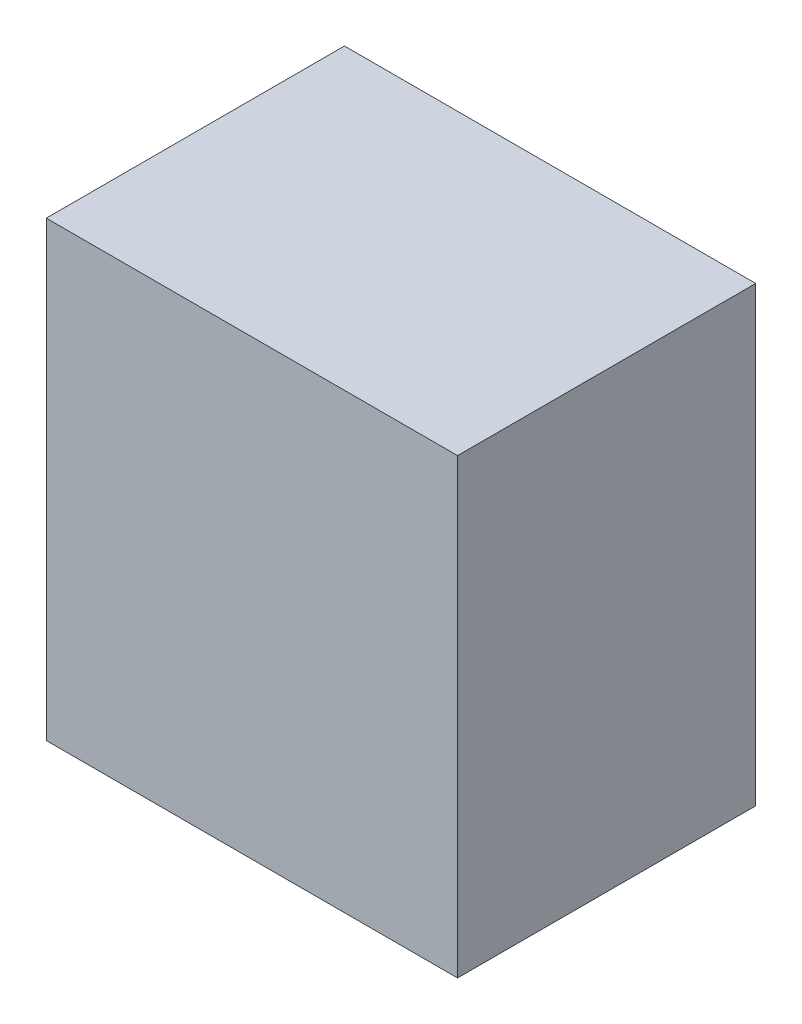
ISO-10303-21;
HEADER;
FILE_DESCRIPTION(('STEP AP214'),'2;1');
FILE_NAME('part.step','',(''),(''),'','','');
FILE_SCHEMA(('AUTOMOTIVE_DESIGN { 1 0 10303 214 1 1 1 1 }'));
ENDSEC;
DATA;
#1=APPLICATION_CONTEXT('core data for automotive mechanical design processes');
#2=APPLICATION_PROTOCOL_DEFINITION('international standard','automotive_design',2000,#1);
#3=PRODUCT_CONTEXT('',#1,'mechanical');
#4=PRODUCT('Part','Part','',(#3));
#5=PRODUCT_RELATED_PRODUCT_CATEGORY('part','',(#4));
#6=PRODUCT_DEFINITION_FORMATION('','',#4);
#7=PRODUCT_DEFINITION_CONTEXT('part definition',#1,'design');
#8=PRODUCT_DEFINITION('design','',#6,#7);
#9=PRODUCT_DEFINITION_SHAPE('','',#8);
#10=(LENGTH_UNIT() NAMED_UNIT(*) SI_UNIT(.MILLI.,.METRE.));
#11=(NAMED_UNIT(*) PLANE_ANGLE_UNIT() SI_UNIT($,.RADIAN.));
#12=(NAMED_UNIT(*) SI_UNIT($,.STERADIAN.) SOLID_ANGLE_UNIT());
#13=UNCERTAINTY_MEASURE_WITH_UNIT(LENGTH_MEASURE(1.E-05),#10,'distance_accuracy_value','');
#14=(GEOMETRIC_REPRESENTATION_CONTEXT(3) GLOBAL_UNCERTAINTY_ASSIGNED_CONTEXT((#13)) GLOBAL_UNIT_ASSIGNED_CONTEXT((#10,
#11,#12)) REPRESENTATION_CONTEXT('',''));
#15=CARTESIAN_POINT('',(0.,0.,0.));
#16=DIRECTION('',(0.,0.,1.));
#17=DIRECTION('',(1.,0.,0.));
#18=AXIS2_PLACEMENT_3D('',#15,#16,#17);
#19=CARTESIAN_POINT('',(0.,0.,0.));
#20=DIRECTION('',(0.,-1.,0.));
#21=DIRECTION('',(0.,0.,-1.));
#22=AXIS2_PLACEMENT_3D('',#19,#20,#21);
#23=PLANE('',#22);
#24=DIRECTION('',(0.,0.,-1.));
#25=VECTOR('',#24,1.);
#26=CARTESIAN_POINT('',(2.,0.,1.45));
#27=LINE('',#26,#25);
#28=CARTESIAN_POINT('',(2.,0.,1.45));
#29=VERTEX_POINT('',#28);
#30=CARTESIAN_POINT('',(2.,0.,-1.45));
#31=VERTEX_POINT('',#30);
#32=EDGE_CURVE('E120',#29,#31,#27,.T.);
#33=ORIENTED_EDGE('',*,*,#32,.F.);
#34=DIRECTION('',(1.,0.,0.));
#35=VECTOR('',#34,1.);
#36=CARTESIAN_POINT('',(-2.,0.,1.45));
#37=LINE('',#36,#35);
#38=CARTESIAN_POINT('',(-2.,0.,1.45));
#39=VERTEX_POINT('',#38);
#40=EDGE_CURVE('E20',#39,#29,#37,.T.);
#41=ORIENTED_EDGE('',*,*,#40,.F.);
#42=DIRECTION('',(0.,0.,1.));
#43=VECTOR('',#42,1.);
#44=CARTESIAN_POINT('',(-2.,0.,1.45));
#45=LINE('',#44,#43);
#46=CARTESIAN_POINT('',(-2.,0.,-1.45));
#47=VERTEX_POINT('',#46);
#48=EDGE_CURVE('E71',#47,#39,#45,.T.);
#49=ORIENTED_EDGE('',*,*,#48,.F.);
#50=DIRECTION('',(-1.,0.,0.));
#51=VECTOR('',#50,1.);
#52=CARTESIAN_POINT('',(-2.,0.,-1.45));
#53=LINE('',#52,#51);
#54=EDGE_CURVE('E74',#31,#47,#53,.T.);
#55=ORIENTED_EDGE('',*,*,#54,.F.);
#56=EDGE_LOOP('',(#33,#41,#49,#55));
#57=FACE_BOUND('',#56,.T.);
#58=ADVANCED_FACE('F17',(#57),#23,.T.);
#59=CARTESIAN_POINT('',(0.,4.4,0.));
#60=DIRECTION('',(0.,-1.,0.));
#61=DIRECTION('',(0.,0.,-1.));
#62=AXIS2_PLACEMENT_3D('',#59,#60,#61);
#63=PLANE('',#62);
#64=DIRECTION('',(0.,0.,-1.));
#65=VECTOR('',#64,1.);
#66=CARTESIAN_POINT('',(2.,4.4,1.45));
#67=LINE('',#66,#65);
#68=CARTESIAN_POINT('',(2.,4.4,1.45));
#69=VERTEX_POINT('',#68);
#70=CARTESIAN_POINT('',(2.,4.4,-1.45));
#71=VERTEX_POINT('',#70);
#72=EDGE_CURVE('E102',#69,#71,#67,.T.);
#73=ORIENTED_EDGE('',*,*,#72,.T.);
#74=DIRECTION('',(-1.,0.,0.));
#75=VECTOR('',#74,1.);
#76=CARTESIAN_POINT('',(-2.,4.4,-1.45));
#77=LINE('',#76,#75);
#78=CARTESIAN_POINT('',(-2.,4.4,-1.45));
#79=VERTEX_POINT('',#78);
#80=EDGE_CURVE('E80',#71,#79,#77,.T.);
#81=ORIENTED_EDGE('',*,*,#80,.T.);
#82=DIRECTION('',(0.,0.,1.));
#83=VECTOR('',#82,1.);
#84=CARTESIAN_POINT('',(-2.,4.4,1.45));
#85=LINE('',#84,#83);
#86=CARTESIAN_POINT('',(-2.,4.4,1.45));
#87=VERTEX_POINT('',#86);
#88=EDGE_CURVE('E85',#79,#87,#85,.T.);
#89=ORIENTED_EDGE('',*,*,#88,.T.);
#90=DIRECTION('',(1.,0.,0.));
#91=VECTOR('',#90,1.);
#92=CARTESIAN_POINT('',(-2.,4.4,1.45));
#93=LINE('',#92,#91);
#94=EDGE_CURVE('E11',#87,#69,#93,.T.);
#95=ORIENTED_EDGE('',*,*,#94,.T.);
#96=EDGE_LOOP('',(#73,#81,#89,#95));
#97=FACE_BOUND('',#96,.T.);
#98=ADVANCED_FACE('F131',(#97),#63,.F.);
#99=CARTESIAN_POINT('',(-2.,4.4,1.45));
#100=DIRECTION('',(0.,0.,-1.));
#101=DIRECTION('',(0.,-1.,0.));
#102=AXIS2_PLACEMENT_3D('',#99,#100,#101);
#103=PLANE('',#102);
#104=ORIENTED_EDGE('',*,*,#40,.T.);
#105=DIRECTION('',(0.,-1.,0.));
#106=VECTOR('',#105,1.);
#107=CARTESIAN_POINT('',(2.,4.4,1.45));
#108=LINE('',#107,#106);
#109=EDGE_CURVE('E95',#69,#29,#108,.T.);
#110=ORIENTED_EDGE('',*,*,#109,.F.);
#111=ORIENTED_EDGE('',*,*,#94,.F.);
#112=DIRECTION('',(0.,-1.,0.));
#113=VECTOR('',#112,1.);
#114=CARTESIAN_POINT('',(-2.,4.4,1.45));
#115=LINE('',#114,#113);
#116=EDGE_CURVE('E79',#87,#39,#115,.T.);
#117=ORIENTED_EDGE('',*,*,#116,.T.);
#118=EDGE_LOOP('',(#104,#110,#111,#117));
#119=FACE_BOUND('',#118,.T.);
#120=ADVANCED_FACE('F116',(#119),#103,.F.);
#121=CARTESIAN_POINT('',(-2.,4.4,1.45));
#122=DIRECTION('',(1.,0.,0.));
#123=DIRECTION('',(0.,1.,0.));
#124=AXIS2_PLACEMENT_3D('',#121,#122,#123);
#125=PLANE('',#124);
#126=ORIENTED_EDGE('',*,*,#48,.T.);
#127=ORIENTED_EDGE('',*,*,#116,.F.);
#128=ORIENTED_EDGE('',*,*,#88,.F.);
#129=DIRECTION('',(0.,-1.,0.));
#130=VECTOR('',#129,1.);
#131=CARTESIAN_POINT('',(-2.,4.4,-1.45));
#132=LINE('',#131,#130);
#133=EDGE_CURVE('E83',#79,#47,#132,.T.);
#134=ORIENTED_EDGE('',*,*,#133,.T.);
#135=EDGE_LOOP('',(#126,#127,#128,#134));
#136=FACE_BOUND('',#135,.T.);
#137=ADVANCED_FACE('F84',(#136),#125,.F.);
#138=CARTESIAN_POINT('',(-2.,4.4,-1.45));
#139=DIRECTION('',(0.,0.,1.));
#140=DIRECTION('',(1.,0.,0.));
#141=AXIS2_PLACEMENT_3D('',#138,#139,#140);
#142=PLANE('',#141);
#143=ORIENTED_EDGE('',*,*,#54,.T.);
#144=ORIENTED_EDGE('',*,*,#133,.F.);
#145=ORIENTED_EDGE('',*,*,#80,.F.);
#146=DIRECTION('',(0.,-1.,0.));
#147=VECTOR('',#146,1.);
#148=CARTESIAN_POINT('',(2.,4.4,-1.45));
#149=LINE('',#148,#147);
#150=EDGE_CURVE('E92',#71,#31,#149,.T.);
#151=ORIENTED_EDGE('',*,*,#150,.T.);
#152=EDGE_LOOP('',(#143,#144,#145,#151));
#153=FACE_BOUND('',#152,.T.);
#154=ADVANCED_FACE('F90',(#153),#142,.F.);
#155=CARTESIAN_POINT('',(2.,4.4,1.45));
#156=DIRECTION('',(-1.,0.,0.));
#157=DIRECTION('',(0.,0.,1.));
#158=AXIS2_PLACEMENT_3D('',#155,#156,#157);
#159=PLANE('',#158);
#160=ORIENTED_EDGE('',*,*,#32,.T.);
#161=ORIENTED_EDGE('',*,*,#150,.F.);
#162=ORIENTED_EDGE('',*,*,#72,.F.);
#163=ORIENTED_EDGE('',*,*,#109,.T.);
#164=EDGE_LOOP('',(#160,#161,#162,#163));
#165=FACE_BOUND('',#164,.T.);
#166=ADVANCED_FACE('F119',(#165),#159,.F.);
#167=CLOSED_SHELL('',(#58,#98,#120,#137,#154,#166));
#168=MANIFOLD_SOLID_BREP('B1',#167);
#169=ADVANCED_BREP_SHAPE_REPRESENTATION('',(#18,#168),#14);
#170=SHAPE_DEFINITION_REPRESENTATION(#9,#169);
ENDSEC;
END-ISO-10303-21;
